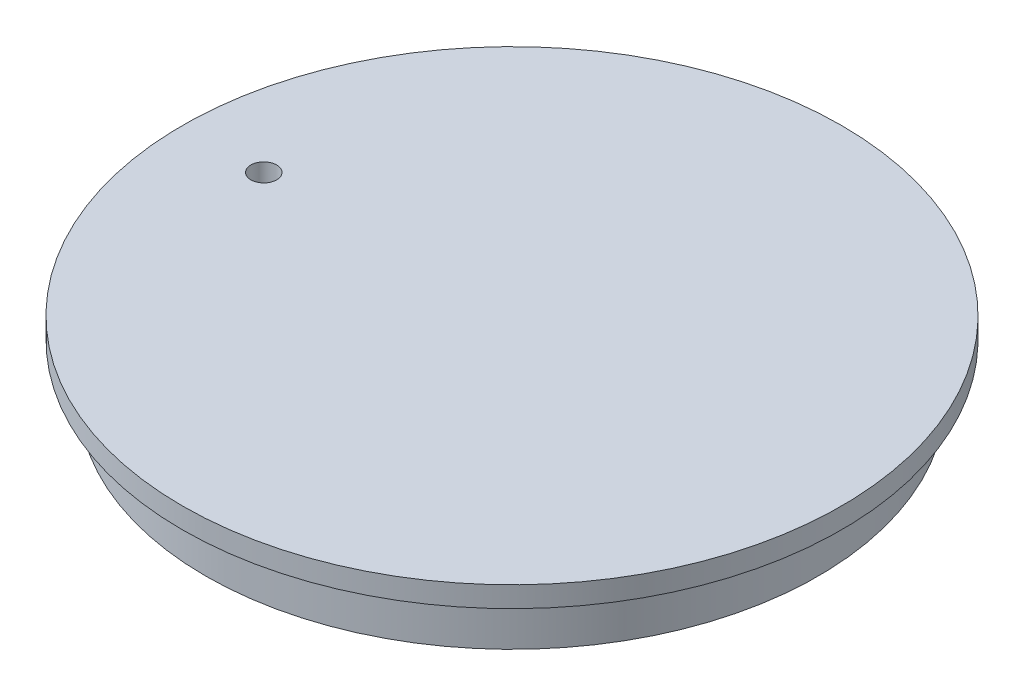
from build123d import *

# Parameters (mm, degrees)
ESQUISSE2_R             = 1
ENL_V_MAT_EXTRU_1_DEPTH = 37.494657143


with BuildPart() as part:
    # Esquisse1 → R_volution1 (revolve)
    with BuildSketch(Plane.XY, mode=Mode.PRIVATE) as r_volution1_sk:
        Polygon((0, 0), (-25.5, 0), (-25.5, -1.6), (-23.7, -1.6), (-23.7, -5.6), (-22.1, -5.6), (-21.394692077, -1.6), (0, -1.6), align=None)
    revolve(r_volution1_sk.sketch.rotate(Axis((0, -1.6, 0), (0, 1, 0)), 270), axis=Axis((0, -1.6, 0), (0, 1, 0)))

    # Esquisse2 → Enl_v. mat.-Extru.1 (cut, through all)
    with BuildSketch(Plane(origin=(0, 0, 0), x_dir=(1, 0, 0), z_dir=(0, 1, 0))):
        with Locations(Location((-19.206490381, 0, 0), (0, 0, 270))):
            Circle(ESQUISSE2_R)
    extrude(amount=-ENL_V_MAT_EXTRU_1_DEPTH, mode=Mode.SUBTRACT)


solid = part.part
